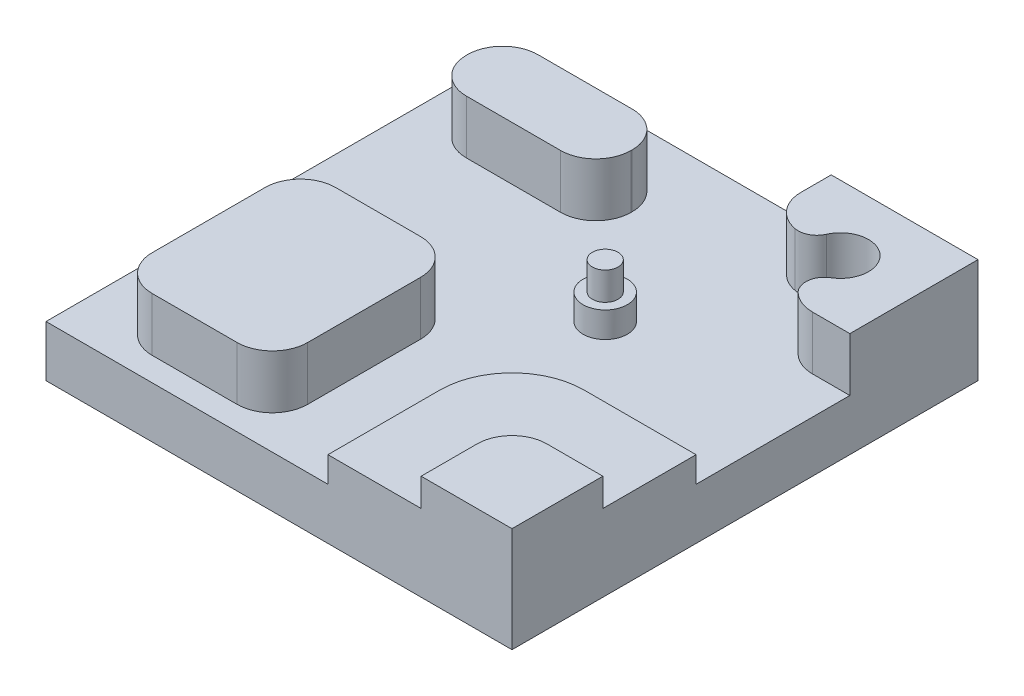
ISO-10303-21;
HEADER;
FILE_DESCRIPTION(('STEP AP214'),'2;1');
FILE_NAME('part.step','',(''),(''),'','','');
FILE_SCHEMA(('AUTOMOTIVE_DESIGN { 1 0 10303 214 1 1 1 1 }'));
ENDSEC;
DATA;
#1=APPLICATION_CONTEXT('core data for automotive mechanical design processes');
#2=APPLICATION_PROTOCOL_DEFINITION('international standard','automotive_design',2000,#1);
#3=PRODUCT_CONTEXT('',#1,'mechanical');
#4=PRODUCT('Part','Part','',(#3));
#5=PRODUCT_RELATED_PRODUCT_CATEGORY('part','',(#4));
#6=PRODUCT_DEFINITION_FORMATION('','',#4);
#7=PRODUCT_DEFINITION_CONTEXT('part definition',#1,'design');
#8=PRODUCT_DEFINITION('design','',#6,#7);
#9=PRODUCT_DEFINITION_SHAPE('','',#8);
#10=(LENGTH_UNIT() NAMED_UNIT(*) SI_UNIT(.MILLI.,.METRE.));
#11=(NAMED_UNIT(*) PLANE_ANGLE_UNIT() SI_UNIT($,.RADIAN.));
#12=(NAMED_UNIT(*) SI_UNIT($,.STERADIAN.) SOLID_ANGLE_UNIT());
#13=UNCERTAINTY_MEASURE_WITH_UNIT(LENGTH_MEASURE(1.E-05),#10,'distance_accuracy_value','');
#14=(GEOMETRIC_REPRESENTATION_CONTEXT(3) GLOBAL_UNCERTAINTY_ASSIGNED_CONTEXT((#13)) GLOBAL_UNIT_ASSIGNED_CONTEXT((#10,
#11,#12)) REPRESENTATION_CONTEXT('',''));
#15=CARTESIAN_POINT('',(0.,0.,0.));
#16=DIRECTION('',(0.,0.,1.));
#17=DIRECTION('',(1.,0.,0.));
#18=AXIS2_PLACEMENT_3D('',#15,#16,#17);
#19=CARTESIAN_POINT('',(0.,5.5,0.));
#20=DIRECTION('',(0.,-1.,0.));
#21=DIRECTION('',(0.,0.,-1.));
#22=AXIS2_PLACEMENT_3D('',#19,#20,#21);
#23=PLANE('',#22);
#24=CARTESIAN_POINT('',(5.,5.5,-5.00000000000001));
#25=DIRECTION('',(0.,-1.,0.));
#26=DIRECTION('',(0.,0.,-1.));
#27=AXIS2_PLACEMENT_3D('',#24,#25,#26);
#28=CIRCLE('',#27,2.375);
#29=CARTESIAN_POINT('',(5.,5.5,-7.37500000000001));
#30=VERTEX_POINT('',#29);
#31=EDGE_CURVE('E552',#30,#30,#28,.F.);
#32=ORIENTED_EDGE('',*,*,#31,.F.);
#33=EDGE_LOOP('',(#32));
#34=FACE_BOUND('',#33,.T.);
#35=DIRECTION('',(0.,0.,1.));
#36=VECTOR('',#35,1.);
#37=CARTESIAN_POINT('',(-19.95,5.5,22.45));
#38=LINE('',#37,#36);
#39=CARTESIAN_POINT('',(-19.95,5.5,6.54999999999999));
#40=VERTEX_POINT('',#39);
#41=CARTESIAN_POINT('',(-19.95,5.5,18.66));
#42=VERTEX_POINT('',#41);
#43=EDGE_CURVE('E625',#40,#42,#38,.T.);
#44=ORIENTED_EDGE('',*,*,#43,.F.);
#45=CARTESIAN_POINT('',(-16.16,5.5,6.54999999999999));
#46=DIRECTION('',(0.,-1.,0.));
#47=DIRECTION('',(0.,0.,-1.));
#48=AXIS2_PLACEMENT_3D('',#45,#46,#47);
#49=CIRCLE('',#48,3.79);
#50=CARTESIAN_POINT('',(-16.16,5.5,2.75999999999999));
#51=VERTEX_POINT('',#50);
#52=EDGE_CURVE('E491',#40,#51,#49,.T.);
#53=ORIENTED_EDGE('',*,*,#52,.T.);
#54=DIRECTION('',(-1.,0.,0.));
#55=VECTOR('',#54,1.);
#56=CARTESIAN_POINT('',(-19.95,5.5,2.75999999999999));
#57=LINE('',#56,#55);
#58=CARTESIAN_POINT('',(-7.05000000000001,5.5,2.75999999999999));
#59=VERTEX_POINT('',#58);
#60=EDGE_CURVE('E638',#59,#51,#57,.T.);
#61=ORIENTED_EDGE('',*,*,#60,.F.);
#62=CARTESIAN_POINT('',(-7.05000000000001,5.5,6.54999999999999));
#63=DIRECTION('',(0.,-1.,0.));
#64=DIRECTION('',(0.,0.,-1.));
#65=AXIS2_PLACEMENT_3D('',#62,#63,#64);
#66=CIRCLE('',#65,3.79);
#67=CARTESIAN_POINT('',(-3.26000000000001,5.5,6.54999999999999));
#68=VERTEX_POINT('',#67);
#69=EDGE_CURVE('E488',#59,#68,#66,.T.);
#70=ORIENTED_EDGE('',*,*,#69,.T.);
#71=DIRECTION('',(0.,0.,-1.));
#72=VECTOR('',#71,1.);
#73=CARTESIAN_POINT('',(-3.26000000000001,5.5,22.45));
#74=LINE('',#73,#72);
#75=CARTESIAN_POINT('',(-3.26000000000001,5.5,18.66));
#76=VERTEX_POINT('',#75);
#77=EDGE_CURVE('E634',#76,#68,#74,.T.);
#78=ORIENTED_EDGE('',*,*,#77,.F.);
#79=CARTESIAN_POINT('',(-7.05000000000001,5.5,18.66));
#80=DIRECTION('',(0.,-1.,0.));
#81=DIRECTION('',(0.,0.,-1.));
#82=AXIS2_PLACEMENT_3D('',#79,#80,#81);
#83=CIRCLE('',#82,3.79);
#84=CARTESIAN_POINT('',(-7.05000000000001,5.5,22.45));
#85=VERTEX_POINT('',#84);
#86=EDGE_CURVE('E494',#76,#85,#83,.T.);
#87=ORIENTED_EDGE('',*,*,#86,.T.);
#88=DIRECTION('',(1.,0.,0.));
#89=VECTOR('',#88,1.);
#90=CARTESIAN_POINT('',(-19.95,5.5,22.45));
#91=LINE('',#90,#89);
#92=CARTESIAN_POINT('',(-16.16,5.5,22.45));
#93=VERTEX_POINT('',#92);
#94=EDGE_CURVE('E629',#93,#85,#91,.T.);
#95=ORIENTED_EDGE('',*,*,#94,.F.);
#96=CARTESIAN_POINT('',(-16.16,5.5,18.66));
#97=DIRECTION('',(0.,-1.,0.));
#98=DIRECTION('',(0.,0.,-1.));
#99=AXIS2_PLACEMENT_3D('',#96,#97,#98);
#100=CIRCLE('',#99,3.79);
#101=EDGE_CURVE('E497',#93,#42,#100,.T.);
#102=ORIENTED_EDGE('',*,*,#101,.T.);
#103=EDGE_LOOP('',(#44,#53,#61,#70,#78,#87,#95,#102));
#104=FACE_BOUND('',#103,.T.);
#105=CARTESIAN_POINT('',(21.,5.5,-15.));
#106=DIRECTION('',(0.,-1.,0.));
#107=DIRECTION('',(0.,0.,-1.));
#108=AXIS2_PLACEMENT_3D('',#105,#106,#107);
#109=CIRCLE('',#108,3.75);
#110=CARTESIAN_POINT('',(21.,5.5,-11.25));
#111=VERTEX_POINT('',#110);
#112=CARTESIAN_POINT('',(18.466653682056,5.5,-12.2351028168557));
#113=VERTEX_POINT('',#112);
#114=EDGE_CURVE('E442',#111,#113,#109,.T.);
#115=ORIENTED_EDGE('',*,*,#114,.T.);
#116=CARTESIAN_POINT('',(19.8177717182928,5.5,-13.709714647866));
#117=DIRECTION('',(0.,-1.,0.));
#118=DIRECTION('',(0.,0.,-1.));
#119=AXIS2_PLACEMENT_3D('',#116,#117,#118);
#120=CIRCLE('',#119,2.);
#121=CARTESIAN_POINT('',(18.7906630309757,5.5,-15.4258287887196));
#122=VERTEX_POINT('',#121);
#123=EDGE_CURVE('E50',#113,#122,#120,.T.);
#124=ORIENTED_EDGE('',*,*,#123,.T.);
#125=CARTESIAN_POINT('',(17.25,5.5,-18.));
#126=DIRECTION('',(0.,1.,0.));
#127=DIRECTION('',(0.,0.,1.));
#128=AXIS2_PLACEMENT_3D('',#125,#126,#127);
#129=CIRCLE('',#128,3.);
#130=CARTESIAN_POINT('',(14.5082300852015,5.5,-19.2176607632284));
#131=VERTEX_POINT('',#130);
#132=EDGE_CURVE('E597',#122,#131,#129,.T.);
#133=ORIENTED_EDGE('',*,*,#132,.T.);
#134=CARTESIAN_POINT('',(12.6803834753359,5.5,-20.0294346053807));
#135=DIRECTION('',(0.,-1.,0.));
#136=DIRECTION('',(0.,0.,-1.));
#137=AXIS2_PLACEMENT_3D('',#134,#135,#136);
#138=CIRCLE('',#137,2.);
#139=CARTESIAN_POINT('',(12.3151074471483,5.5,-18.0630741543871));
#140=VERTEX_POINT('',#139);
#141=EDGE_CURVE('E11',#131,#140,#138,.T.);
#142=ORIENTED_EDGE('',*,*,#141,.T.);
#143=CARTESIAN_POINT('',(13.,5.5,-21.75));
#144=DIRECTION('',(0.,-1.,0.));
#145=DIRECTION('',(0.,0.,-1.));
#146=AXIS2_PLACEMENT_3D('',#143,#144,#145);
#147=CIRCLE('',#146,3.75);
#148=CARTESIAN_POINT('',(9.25000000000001,5.5,-21.75));
#149=VERTEX_POINT('',#148);
#150=EDGE_CURVE('E445',#140,#149,#147,.T.);
#151=ORIENTED_EDGE('',*,*,#150,.T.);
#152=DIRECTION('',(0.,0.,1.));
#153=VECTOR('',#152,1.);
#154=CARTESIAN_POINT('',(9.25000000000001,5.5,-25.));
#155=LINE('',#154,#153);
#156=CARTESIAN_POINT('',(9.25000000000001,5.5,-25.));
#157=VERTEX_POINT('',#156);
#158=EDGE_CURVE('E299',#157,#149,#155,.T.);
#159=ORIENTED_EDGE('',*,*,#158,.F.);
#160=DIRECTION('',(-1.,0.,0.));
#161=VECTOR('',#160,1.);
#162=CARTESIAN_POINT('',(25.,5.5,-25.));
#163=LINE('',#162,#161);
#164=CARTESIAN_POINT('',(-25.,5.5,-25.));
#165=VERTEX_POINT('',#164);
#166=EDGE_CURVE('E376',#157,#165,#163,.T.);
#167=ORIENTED_EDGE('',*,*,#166,.T.);
#168=DIRECTION('',(0.,0.,-1.));
#169=VECTOR('',#168,1.);
#170=CARTESIAN_POINT('',(-25.,5.5,25.));
#171=LINE('',#170,#169);
#172=CARTESIAN_POINT('',(-25.,5.5,25.));
#173=VERTEX_POINT('',#172);
#174=EDGE_CURVE('E379',#173,#165,#171,.T.);
#175=ORIENTED_EDGE('',*,*,#174,.F.);
#176=DIRECTION('',(-1.,0.,0.));
#177=VECTOR('',#176,1.);
#178=CARTESIAN_POINT('',(25.,5.5,25.));
#179=LINE('',#178,#177);
#180=CARTESIAN_POINT('',(5.25,5.5,25.));
#181=VERTEX_POINT('',#180);
#182=EDGE_CURVE('E384',#181,#173,#179,.T.);
#183=ORIENTED_EDGE('',*,*,#182,.F.);
#184=DIRECTION('',(0.,0.,1.));
#185=VECTOR('',#184,1.);
#186=CARTESIAN_POINT('',(5.25,5.5,25.));
#187=LINE('',#186,#185);
#188=CARTESIAN_POINT('',(5.25,5.5,13.));
#189=VERTEX_POINT('',#188);
#190=EDGE_CURVE('E325',#189,#181,#187,.T.);
#191=ORIENTED_EDGE('',*,*,#190,.F.);
#192=CARTESIAN_POINT('',(13.,5.5,13.));
#193=DIRECTION('',(0.,-1.,0.));
#194=DIRECTION('',(0.,0.,-1.));
#195=AXIS2_PLACEMENT_3D('',#192,#193,#194);
#196=CIRCLE('',#195,7.75);
#197=CARTESIAN_POINT('',(13.,5.5,5.24999999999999));
#198=VERTEX_POINT('',#197);
#199=EDGE_CURVE('E572',#189,#198,#196,.T.);
#200=ORIENTED_EDGE('',*,*,#199,.T.);
#201=DIRECTION('',(-1.,0.,0.));
#202=VECTOR('',#201,1.);
#203=CARTESIAN_POINT('',(25.,5.5,5.24999999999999));
#204=LINE('',#203,#202);
#205=CARTESIAN_POINT('',(25.,5.5,5.24999999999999));
#206=VERTEX_POINT('',#205);
#207=EDGE_CURVE('E320',#206,#198,#204,.T.);
#208=ORIENTED_EDGE('',*,*,#207,.F.);
#209=DIRECTION('',(0.,0.,-1.));
#210=VECTOR('',#209,1.);
#211=CARTESIAN_POINT('',(25.,5.5,25.));
#212=LINE('',#211,#210);
#213=CARTESIAN_POINT('',(25.,5.5,-11.25));
#214=VERTEX_POINT('',#213);
#215=EDGE_CURVE('E387',#206,#214,#212,.T.);
#216=ORIENTED_EDGE('',*,*,#215,.T.);
#217=DIRECTION('',(1.,0.,0.));
#218=VECTOR('',#217,1.);
#219=CARTESIAN_POINT('',(25.,5.5,-11.25));
#220=LINE('',#219,#218);
#221=EDGE_CURVE('E287',#111,#214,#220,.T.);
#222=ORIENTED_EDGE('',*,*,#221,.F.);
#223=EDGE_LOOP('',(#115,#124,#133,#142,#151,#159,#167,#175,#183,#191,#200,#208,#216,#222));
#224=FACE_BOUND('',#223,.T.);
#225=DIRECTION('',(0.,0.,1.));
#226=VECTOR('',#225,1.);
#227=CARTESIAN_POINT('',(-21.44,5.5,-20.44));
#228=LINE('',#227,#226);
#229=CARTESIAN_POINT('',(-21.44,5.5,-16.65));
#230=VERTEX_POINT('',#229);
#231=CARTESIAN_POINT('',(-21.44,5.5,-16.54));
#232=VERTEX_POINT('',#231);
#233=EDGE_CURVE('E666',#230,#232,#228,.T.);
#234=ORIENTED_EDGE('',*,*,#233,.F.);
#235=CARTESIAN_POINT('',(-17.65,5.5,-16.65));
#236=DIRECTION('',(0.,-1.,0.));
#237=DIRECTION('',(0.,0.,-1.));
#238=AXIS2_PLACEMENT_3D('',#235,#236,#237);
#239=CIRCLE('',#238,3.79);
#240=CARTESIAN_POINT('',(-17.65,5.5,-20.44));
#241=VERTEX_POINT('',#240);
#242=EDGE_CURVE('E549',#230,#241,#239,.T.);
#243=ORIENTED_EDGE('',*,*,#242,.T.);
#244=DIRECTION('',(-1.,0.,0.));
#245=VECTOR('',#244,1.);
#246=CARTESIAN_POINT('',(-21.44,5.5,-20.44));
#247=LINE('',#246,#245);
#248=CARTESIAN_POINT('',(-7.54,5.5,-20.44));
#249=VERTEX_POINT('',#248);
#250=EDGE_CURVE('E653',#249,#241,#247,.T.);
#251=ORIENTED_EDGE('',*,*,#250,.F.);
#252=CARTESIAN_POINT('',(-7.54,5.5,-16.65));
#253=DIRECTION('',(0.,-1.,0.));
#254=DIRECTION('',(0.,0.,-1.));
#255=AXIS2_PLACEMENT_3D('',#252,#253,#254);
#256=CIRCLE('',#255,3.79);
#257=CARTESIAN_POINT('',(-3.75,5.5,-16.65));
#258=VERTEX_POINT('',#257);
#259=EDGE_CURVE('E546',#249,#258,#256,.T.);
#260=ORIENTED_EDGE('',*,*,#259,.T.);
#261=DIRECTION('',(0.,0.,-1.));
#262=VECTOR('',#261,1.);
#263=CARTESIAN_POINT('',(-3.75,5.5,-20.44));
#264=LINE('',#263,#262);
#265=CARTESIAN_POINT('',(-3.75,5.5,-16.54));
#266=VERTEX_POINT('',#265);
#267=EDGE_CURVE('E658',#266,#258,#264,.T.);
#268=ORIENTED_EDGE('',*,*,#267,.F.);
#269=CARTESIAN_POINT('',(-7.54,5.5,-16.54));
#270=DIRECTION('',(0.,-1.,0.));
#271=DIRECTION('',(0.,0.,-1.));
#272=AXIS2_PLACEMENT_3D('',#269,#270,#271);
#273=CIRCLE('',#272,3.79);
#274=CARTESIAN_POINT('',(-7.54,5.5,-12.75));
#275=VERTEX_POINT('',#274);
#276=EDGE_CURVE('E540',#266,#275,#273,.T.);
#277=ORIENTED_EDGE('',*,*,#276,.T.);
#278=DIRECTION('',(1.,0.,0.));
#279=VECTOR('',#278,1.);
#280=CARTESIAN_POINT('',(-21.44,5.5,-12.75));
#281=LINE('',#280,#279);
#282=CARTESIAN_POINT('',(-17.65,5.5,-12.75));
#283=VERTEX_POINT('',#282);
#284=EDGE_CURVE('E662',#283,#275,#281,.T.);
#285=ORIENTED_EDGE('',*,*,#284,.F.);
#286=CARTESIAN_POINT('',(-17.65,5.5,-16.54));
#287=DIRECTION('',(0.,-1.,0.));
#288=DIRECTION('',(0.,0.,-1.));
#289=AXIS2_PLACEMENT_3D('',#286,#287,#288);
#290=CIRCLE('',#289,3.79);
#291=EDGE_CURVE('E543',#283,#232,#290,.T.);
#292=ORIENTED_EDGE('',*,*,#291,.T.);
#293=EDGE_LOOP('',(#234,#243,#251,#260,#268,#277,#285,#292));
#294=FACE_BOUND('',#293,.T.);
#295=ADVANCED_FACE('F41',(#34,#104,#224,#294),#23,.F.);
#296=CARTESIAN_POINT('',(25.,5.5,-25.));
#297=DIRECTION('',(0.,0.,1.));
#298=DIRECTION('',(1.,0.,0.));
#299=AXIS2_PLACEMENT_3D('',#296,#297,#298);
#300=PLANE('',#299);
#301=DIRECTION('',(-1.,0.,0.));
#302=VECTOR('',#301,1.);
#303=CARTESIAN_POINT('',(25.,0.,-25.));
#304=LINE('',#303,#302);
#305=CARTESIAN_POINT('',(25.,0.,-25.));
#306=VERTEX_POINT('',#305);
#307=CARTESIAN_POINT('',(-25.,0.,-25.));
#308=VERTEX_POINT('',#307);
#309=EDGE_CURVE('E375',#306,#308,#304,.T.);
#310=ORIENTED_EDGE('',*,*,#309,.T.);
#311=DIRECTION('',(0.,-1.,0.));
#312=VECTOR('',#311,1.);
#313=CARTESIAN_POINT('',(-25.,5.5,-25.));
#314=LINE('',#313,#312);
#315=EDGE_CURVE('E411',#165,#308,#314,.T.);
#316=ORIENTED_EDGE('',*,*,#315,.F.);
#317=ORIENTED_EDGE('',*,*,#166,.F.);
#318=DIRECTION('',(0.,-1.,0.));
#319=VECTOR('',#318,1.);
#320=CARTESIAN_POINT('',(9.25000000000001,11.25,-25.));
#321=LINE('',#320,#319);
#322=CARTESIAN_POINT('',(9.25000000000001,11.25,-25.));
#323=VERTEX_POINT('',#322);
#324=EDGE_CURVE('E315',#323,#157,#321,.T.);
#325=ORIENTED_EDGE('',*,*,#324,.F.);
#326=DIRECTION('',(-1.,0.,0.));
#327=VECTOR('',#326,1.);
#328=CARTESIAN_POINT('',(25.,11.25,-25.));
#329=LINE('',#328,#327);
#330=CARTESIAN_POINT('',(25.,11.25,-25.));
#331=VERTEX_POINT('',#330);
#332=EDGE_CURVE('E298',#331,#323,#329,.T.);
#333=ORIENTED_EDGE('',*,*,#332,.F.);
#334=DIRECTION('',(0.,-1.,0.));
#335=VECTOR('',#334,1.);
#336=CARTESIAN_POINT('',(25.,5.5,-25.));
#337=LINE('',#336,#335);
#338=EDGE_CURVE('E295',#331,#306,#337,.T.);
#339=ORIENTED_EDGE('',*,*,#338,.T.);
#340=EDGE_LOOP('',(#310,#316,#317,#325,#333,#339));
#341=FACE_BOUND('',#340,.T.);
#342=ADVANCED_FACE('F705',(#341),#300,.F.);
#343=CARTESIAN_POINT('',(-25.,5.5,25.));
#344=DIRECTION('',(-1.,0.,0.));
#345=DIRECTION('',(0.,0.,1.));
#346=AXIS2_PLACEMENT_3D('',#343,#344,#345);
#347=PLANE('',#346);
#348=DIRECTION('',(0.,0.,-1.));
#349=VECTOR('',#348,1.);
#350=CARTESIAN_POINT('',(-25.,0.,25.));
#351=LINE('',#350,#349);
#352=CARTESIAN_POINT('',(-25.,0.,25.));
#353=VERTEX_POINT('',#352);
#354=EDGE_CURVE('E393',#353,#308,#351,.T.);
#355=ORIENTED_EDGE('',*,*,#354,.F.);
#356=DIRECTION('',(0.,-1.,0.));
#357=VECTOR('',#356,1.);
#358=CARTESIAN_POINT('',(-25.,5.5,25.));
#359=LINE('',#358,#357);
#360=EDGE_CURVE('E408',#173,#353,#359,.T.);
#361=ORIENTED_EDGE('',*,*,#360,.F.);
#362=ORIENTED_EDGE('',*,*,#174,.T.);
#363=ORIENTED_EDGE('',*,*,#315,.T.);
#364=EDGE_LOOP('',(#355,#361,#362,#363));
#365=FACE_BOUND('',#364,.T.);
#366=ADVANCED_FACE('F710',(#365),#347,.T.);
#367=CARTESIAN_POINT('',(25.,5.5,25.));
#368=DIRECTION('',(0.,0.,1.));
#369=DIRECTION('',(1.,0.,0.));
#370=AXIS2_PLACEMENT_3D('',#367,#368,#369);
#371=PLANE('',#370);
#372=DIRECTION('',(0.,-1.,0.));
#373=VECTOR('',#372,1.);
#374=CARTESIAN_POINT('',(15.25,11.25,25.));
#375=LINE('',#374,#373);
#376=CARTESIAN_POINT('',(15.25,11.25,25.));
#377=VERTEX_POINT('',#376);
#378=CARTESIAN_POINT('',(15.25,8.25,25.));
#379=VERTEX_POINT('',#378);
#380=EDGE_CURVE('E367',#377,#379,#375,.T.);
#381=ORIENTED_EDGE('',*,*,#380,.T.);
#382=DIRECTION('',(1.,0.,0.));
#383=VECTOR('',#382,1.);
#384=CARTESIAN_POINT('',(25.,8.25,25.));
#385=LINE('',#384,#383);
#386=CARTESIAN_POINT('',(5.25,8.25,25.));
#387=VERTEX_POINT('',#386);
#388=EDGE_CURVE('E332',#387,#379,#385,.T.);
#389=ORIENTED_EDGE('',*,*,#388,.F.);
#390=DIRECTION('',(0.,-1.,0.));
#391=VECTOR('',#390,1.);
#392=CARTESIAN_POINT('',(5.25,8.25,25.));
#393=LINE('',#392,#391);
#394=EDGE_CURVE('E336',#387,#181,#393,.T.);
#395=ORIENTED_EDGE('',*,*,#394,.T.);
#396=ORIENTED_EDGE('',*,*,#182,.T.);
#397=ORIENTED_EDGE('',*,*,#360,.T.);
#398=DIRECTION('',(-1.,0.,0.));
#399=VECTOR('',#398,1.);
#400=CARTESIAN_POINT('',(25.,0.,25.));
#401=LINE('',#400,#399);
#402=CARTESIAN_POINT('',(25.,0.,25.));
#403=VERTEX_POINT('',#402);
#404=EDGE_CURVE('E397',#403,#353,#401,.T.);
#405=ORIENTED_EDGE('',*,*,#404,.F.);
#406=DIRECTION('',(0.,-1.,0.));
#407=VECTOR('',#406,1.);
#408=CARTESIAN_POINT('',(25.,5.5,25.));
#409=LINE('',#408,#407);
#410=CARTESIAN_POINT('',(25.,11.25,25.));
#411=VERTEX_POINT('',#410);
#412=EDGE_CURVE('E405',#411,#403,#409,.T.);
#413=ORIENTED_EDGE('',*,*,#412,.F.);
#414=DIRECTION('',(1.,0.,0.));
#415=VECTOR('',#414,1.);
#416=CARTESIAN_POINT('',(25.,11.25,25.));
#417=LINE('',#416,#415);
#418=EDGE_CURVE('E363',#377,#411,#417,.T.);
#419=ORIENTED_EDGE('',*,*,#418,.F.);
#420=EDGE_LOOP('',(#381,#389,#395,#396,#397,#405,#413,#419));
#421=FACE_BOUND('',#420,.T.);
#422=ADVANCED_FACE('F714',(#421),#371,.T.);
#423=CARTESIAN_POINT('',(25.,5.5,25.));
#424=DIRECTION('',(-1.,0.,0.));
#425=DIRECTION('',(0.,0.,1.));
#426=AXIS2_PLACEMENT_3D('',#423,#424,#425);
#427=PLANE('',#426);
#428=ORIENTED_EDGE('',*,*,#412,.T.);
#429=DIRECTION('',(0.,0.,-1.));
#430=VECTOR('',#429,1.);
#431=CARTESIAN_POINT('',(25.,0.,25.));
#432=LINE('',#431,#430);
#433=EDGE_CURVE('E380',#403,#306,#432,.T.);
#434=ORIENTED_EDGE('',*,*,#433,.T.);
#435=ORIENTED_EDGE('',*,*,#338,.F.);
#436=DIRECTION('',(0.,0.,-1.));
#437=VECTOR('',#436,1.);
#438=CARTESIAN_POINT('',(25.,11.25,-25.));
#439=LINE('',#438,#437);
#440=CARTESIAN_POINT('',(25.,11.25,-11.25));
#441=VERTEX_POINT('',#440);
#442=EDGE_CURVE('E279',#441,#331,#439,.T.);
#443=ORIENTED_EDGE('',*,*,#442,.F.);
#444=DIRECTION('',(0.,-1.,0.));
#445=VECTOR('',#444,1.);
#446=CARTESIAN_POINT('',(25.,11.25,-11.25));
#447=LINE('',#446,#445);
#448=EDGE_CURVE('E286',#441,#214,#447,.T.);
#449=ORIENTED_EDGE('',*,*,#448,.T.);
#450=ORIENTED_EDGE('',*,*,#215,.F.);
#451=DIRECTION('',(0.,-1.,0.));
#452=VECTOR('',#451,1.);
#453=CARTESIAN_POINT('',(25.,8.25,5.24999999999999));
#454=LINE('',#453,#452);
#455=CARTESIAN_POINT('',(25.,8.25,5.24999999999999));
#456=VERTEX_POINT('',#455);
#457=EDGE_CURVE('E345',#456,#206,#454,.T.);
#458=ORIENTED_EDGE('',*,*,#457,.F.);
#459=DIRECTION('',(0.,0.,-1.));
#460=VECTOR('',#459,1.);
#461=CARTESIAN_POINT('',(25.,8.25,25.));
#462=LINE('',#461,#460);
#463=CARTESIAN_POINT('',(25.,8.25,15.25));
#464=VERTEX_POINT('',#463);
#465=EDGE_CURVE('E321',#464,#456,#462,.T.);
#466=ORIENTED_EDGE('',*,*,#465,.F.);
#467=DIRECTION('',(0.,-1.,0.));
#468=VECTOR('',#467,1.);
#469=CARTESIAN_POINT('',(25.,11.25,15.25));
#470=LINE('',#469,#468);
#471=CARTESIAN_POINT('',(25.,11.25,15.25));
#472=VERTEX_POINT('',#471);
#473=EDGE_CURVE('E371',#472,#464,#470,.T.);
#474=ORIENTED_EDGE('',*,*,#473,.F.);
#475=DIRECTION('',(0.,0.,-1.));
#476=VECTOR('',#475,1.);
#477=CARTESIAN_POINT('',(25.,11.25,25.));
#478=LINE('',#477,#476);
#479=EDGE_CURVE('E352',#411,#472,#478,.T.);
#480=ORIENTED_EDGE('',*,*,#479,.F.);
#481=EDGE_LOOP('',(#428,#434,#435,#443,#449,#450,#458,#466,#474,#480));
#482=FACE_BOUND('',#481,.T.);
#483=ADVANCED_FACE('F291',(#482),#427,.F.);
#484=CARTESIAN_POINT('',(0.,0.,0.));
#485=DIRECTION('',(0.,-1.,0.));
#486=DIRECTION('',(0.,0.,-1.));
#487=AXIS2_PLACEMENT_3D('',#484,#485,#486);
#488=PLANE('',#487);
#489=ORIENTED_EDGE('',*,*,#309,.F.);
#490=ORIENTED_EDGE('',*,*,#433,.F.);
#491=ORIENTED_EDGE('',*,*,#404,.T.);
#492=ORIENTED_EDGE('',*,*,#354,.T.);
#493=EDGE_LOOP('',(#489,#490,#491,#492));
#494=FACE_BOUND('',#493,.T.);
#495=ADVANCED_FACE('F743',(#494),#488,.T.);
#496=CARTESIAN_POINT('',(25.,11.25,15.25));
#497=DIRECTION('',(0.,0.,1.));
#498=DIRECTION('',(1.,0.,0.));
#499=AXIS2_PLACEMENT_3D('',#496,#497,#498);
#500=PLANE('',#499);
#501=DIRECTION('',(-1.,0.,0.));
#502=VECTOR('',#501,1.);
#503=CARTESIAN_POINT('',(25.,8.25,15.25));
#504=LINE('',#503,#502);
#505=CARTESIAN_POINT('',(19.,8.25,15.25));
#506=VERTEX_POINT('',#505);
#507=EDGE_CURVE('E348',#464,#506,#504,.T.);
#508=ORIENTED_EDGE('',*,*,#507,.T.);
#509=DIRECTION('',(0.,-1.,0.));
#510=VECTOR('',#509,1.);
#511=CARTESIAN_POINT('',(19.,11.25,15.25));
#512=LINE('',#511,#510);
#513=CARTESIAN_POINT('',(19.,11.25,15.25));
#514=VERTEX_POINT('',#513);
#515=EDGE_CURVE('E421',#506,#514,#512,.F.);
#516=ORIENTED_EDGE('',*,*,#515,.T.);
#517=DIRECTION('',(-1.,0.,0.));
#518=VECTOR('',#517,1.);
#519=CARTESIAN_POINT('',(25.,11.25,15.25));
#520=LINE('',#519,#518);
#521=EDGE_CURVE('E356',#472,#514,#520,.T.);
#522=ORIENTED_EDGE('',*,*,#521,.F.);
#523=ORIENTED_EDGE('',*,*,#473,.T.);
#524=EDGE_LOOP('',(#508,#516,#522,#523));
#525=FACE_BOUND('',#524,.T.);
#526=ADVANCED_FACE('F735',(#525),#500,.F.);
#527=CARTESIAN_POINT('',(15.25,11.25,25.));
#528=DIRECTION('',(1.,0.,0.));
#529=DIRECTION('',(0.,0.,-1.));
#530=AXIS2_PLACEMENT_3D('',#527,#528,#529);
#531=PLANE('',#530);
#532=DIRECTION('',(0.,0.,1.));
#533=VECTOR('',#532,1.);
#534=CARTESIAN_POINT('',(15.25,11.25,25.));
#535=LINE('',#534,#533);
#536=CARTESIAN_POINT('',(15.25,11.25,19.));
#537=VERTEX_POINT('',#536);
#538=EDGE_CURVE('E360',#537,#377,#535,.T.);
#539=ORIENTED_EDGE('',*,*,#538,.F.);
#540=DIRECTION('',(0.,-1.,0.));
#541=VECTOR('',#540,1.);
#542=CARTESIAN_POINT('',(15.25,11.25,19.));
#543=LINE('',#542,#541);
#544=CARTESIAN_POINT('',(15.25,8.25,19.));
#545=VERTEX_POINT('',#544);
#546=EDGE_CURVE('E417',#537,#545,#543,.T.);
#547=ORIENTED_EDGE('',*,*,#546,.T.);
#548=DIRECTION('',(0.,0.,1.));
#549=VECTOR('',#548,1.);
#550=CARTESIAN_POINT('',(15.25,8.25,25.));
#551=LINE('',#550,#549);
#552=EDGE_CURVE('E414',#545,#379,#551,.T.);
#553=ORIENTED_EDGE('',*,*,#552,.T.);
#554=ORIENTED_EDGE('',*,*,#380,.F.);
#555=EDGE_LOOP('',(#539,#547,#553,#554));
#556=FACE_BOUND('',#555,.T.);
#557=ADVANCED_FACE('F750',(#556),#531,.F.);
#558=CARTESIAN_POINT('',(0.,11.25,0.));
#559=DIRECTION('',(0.,1.,0.));
#560=DIRECTION('',(0.,0.,1.));
#561=AXIS2_PLACEMENT_3D('',#558,#559,#560);
#562=PLANE('',#561);
#563=ORIENTED_EDGE('',*,*,#521,.T.);
#564=CARTESIAN_POINT('',(19.,11.25,19.));
#565=DIRECTION('',(0.,1.,0.));
#566=DIRECTION('',(0.,0.,1.));
#567=AXIS2_PLACEMENT_3D('',#564,#565,#566);
#568=CIRCLE('',#567,3.75);
#569=EDGE_CURVE('E424',#514,#537,#568,.T.);
#570=ORIENTED_EDGE('',*,*,#569,.T.);
#571=ORIENTED_EDGE('',*,*,#538,.T.);
#572=ORIENTED_EDGE('',*,*,#418,.T.);
#573=ORIENTED_EDGE('',*,*,#479,.T.);
#574=EDGE_LOOP('',(#563,#570,#571,#572,#573));
#575=FACE_BOUND('',#574,.T.);
#576=ADVANCED_FACE('F739',(#575),#562,.T.);
#577=CARTESIAN_POINT('',(0.,8.25,0.));
#578=DIRECTION('',(0.,1.,0.));
#579=DIRECTION('',(0.,0.,1.));
#580=AXIS2_PLACEMENT_3D('',#577,#578,#579);
#581=PLANE('',#580);
#582=DIRECTION('',(-1.,0.,0.));
#583=VECTOR('',#582,1.);
#584=CARTESIAN_POINT('',(25.,8.25,5.24999999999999));
#585=LINE('',#584,#583);
#586=CARTESIAN_POINT('',(13.,8.25,5.24999999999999));
#587=VERTEX_POINT('',#586);
#588=EDGE_CURVE('E324',#456,#587,#585,.T.);
#589=ORIENTED_EDGE('',*,*,#588,.T.);
#590=CARTESIAN_POINT('',(13.,8.25,13.));
#591=DIRECTION('',(0.,1.,0.));
#592=DIRECTION('',(0.,0.,1.));
#593=AXIS2_PLACEMENT_3D('',#590,#591,#592);
#594=CIRCLE('',#593,7.75);
#595=CARTESIAN_POINT('',(5.25,8.25,13.));
#596=VERTEX_POINT('',#595);
#597=EDGE_CURVE('E569',#587,#596,#594,.T.);
#598=ORIENTED_EDGE('',*,*,#597,.T.);
#599=DIRECTION('',(0.,0.,1.));
#600=VECTOR('',#599,1.);
#601=CARTESIAN_POINT('',(5.25,8.25,25.));
#602=LINE('',#601,#600);
#603=EDGE_CURVE('E329',#596,#387,#602,.T.);
#604=ORIENTED_EDGE('',*,*,#603,.T.);
#605=ORIENTED_EDGE('',*,*,#388,.T.);
#606=ORIENTED_EDGE('',*,*,#552,.F.);
#607=CARTESIAN_POINT('',(19.,8.25,19.));
#608=DIRECTION('',(0.,1.,0.));
#609=DIRECTION('',(0.,0.,1.));
#610=AXIS2_PLACEMENT_3D('',#607,#608,#609);
#611=CIRCLE('',#610,3.75);
#612=EDGE_CURVE('E427',#545,#506,#611,.F.);
#613=ORIENTED_EDGE('',*,*,#612,.T.);
#614=ORIENTED_EDGE('',*,*,#507,.F.);
#615=ORIENTED_EDGE('',*,*,#465,.T.);
#616=EDGE_LOOP('',(#589,#598,#604,#605,#606,#613,#614,#615));
#617=FACE_BOUND('',#616,.T.);
#618=ADVANCED_FACE('F768',(#617),#581,.T.);
#619=CARTESIAN_POINT('',(25.,8.25,5.24999999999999));
#620=DIRECTION('',(0.,0.,1.));
#621=DIRECTION('',(1.,0.,0.));
#622=AXIS2_PLACEMENT_3D('',#619,#620,#621);
#623=PLANE('',#622);
#624=ORIENTED_EDGE('',*,*,#207,.T.);
#625=DIRECTION('',(0.,-1.,0.));
#626=VECTOR('',#625,1.);
#627=CARTESIAN_POINT('',(13.,8.25,5.24999999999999));
#628=LINE('',#627,#626);
#629=EDGE_CURVE('E566',#198,#587,#628,.F.);
#630=ORIENTED_EDGE('',*,*,#629,.T.);
#631=ORIENTED_EDGE('',*,*,#588,.F.);
#632=ORIENTED_EDGE('',*,*,#457,.T.);
#633=EDGE_LOOP('',(#624,#630,#631,#632));
#634=FACE_BOUND('',#633,.T.);
#635=ADVANCED_FACE('F727',(#634),#623,.F.);
#636=CARTESIAN_POINT('',(5.25,8.25,25.));
#637=DIRECTION('',(1.,0.,0.));
#638=DIRECTION('',(0.,0.,-1.));
#639=AXIS2_PLACEMENT_3D('',#636,#637,#638);
#640=PLANE('',#639);
#641=ORIENTED_EDGE('',*,*,#603,.F.);
#642=DIRECTION('',(0.,-1.,0.));
#643=VECTOR('',#642,1.);
#644=CARTESIAN_POINT('',(5.25,8.25,13.));
#645=LINE('',#644,#643);
#646=EDGE_CURVE('E556',#596,#189,#645,.T.);
#647=ORIENTED_EDGE('',*,*,#646,.T.);
#648=ORIENTED_EDGE('',*,*,#190,.T.);
#649=ORIENTED_EDGE('',*,*,#394,.F.);
#650=EDGE_LOOP('',(#641,#647,#648,#649));
#651=FACE_BOUND('',#650,.T.);
#652=ADVANCED_FACE('F720',(#651),#640,.F.);
#653=CARTESIAN_POINT('',(19.,11.25,19.));
#654=DIRECTION('',(0.,-1.,0.));
#655=DIRECTION('',(0.,0.,-1.));
#656=AXIS2_PLACEMENT_3D('',#653,#654,#655);
#657=CYLINDRICAL_SURFACE('',#656,3.75);
#658=ORIENTED_EDGE('',*,*,#569,.F.);
#659=ORIENTED_EDGE('',*,*,#515,.F.);
#660=ORIENTED_EDGE('',*,*,#612,.F.);
#661=ORIENTED_EDGE('',*,*,#546,.F.);
#662=EDGE_LOOP('',(#658,#659,#660,#661));
#663=FACE_BOUND('',#662,.T.);
#664=ADVANCED_FACE('F773',(#663),#657,.T.);
#665=CARTESIAN_POINT('',(9.25000000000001,11.25,-25.));
#666=DIRECTION('',(1.,0.,0.));
#667=DIRECTION('',(0.,0.,-1.));
#668=AXIS2_PLACEMENT_3D('',#665,#666,#667);
#669=PLANE('',#668);
#670=ORIENTED_EDGE('',*,*,#158,.T.);
#671=DIRECTION('',(0.,-1.,0.));
#672=VECTOR('',#671,1.);
#673=CARTESIAN_POINT('',(9.25000000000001,11.25,-21.75));
#674=LINE('',#673,#672);
#675=CARTESIAN_POINT('',(9.25000000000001,11.25,-21.75));
#676=VERTEX_POINT('',#675);
#677=EDGE_CURVE('E439',#149,#676,#674,.F.);
#678=ORIENTED_EDGE('',*,*,#677,.T.);
#679=DIRECTION('',(0.,0.,1.));
#680=VECTOR('',#679,1.);
#681=CARTESIAN_POINT('',(9.25000000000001,11.25,-25.));
#682=LINE('',#681,#680);
#683=EDGE_CURVE('E312',#323,#676,#682,.T.);
#684=ORIENTED_EDGE('',*,*,#683,.F.);
#685=ORIENTED_EDGE('',*,*,#324,.T.);
#686=EDGE_LOOP('',(#670,#678,#684,#685));
#687=FACE_BOUND('',#686,.T.);
#688=ADVANCED_FACE('F700',(#687),#669,.F.);
#689=CARTESIAN_POINT('',(0.,11.25,0.));
#690=DIRECTION('',(0.,-1.,0.));
#691=DIRECTION('',(0.,0.,-1.));
#692=AXIS2_PLACEMENT_3D('',#689,#690,#691);
#693=PLANE('',#692);
#694=CARTESIAN_POINT('',(17.25,11.25,-18.));
#695=DIRECTION('',(0.,1.,0.));
#696=DIRECTION('',(0.,0.,1.));
#697=AXIS2_PLACEMENT_3D('',#694,#695,#696);
#698=CIRCLE('',#697,3.);
#699=CARTESIAN_POINT('',(18.7906630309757,11.25,-15.4258287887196));
#700=VERTEX_POINT('',#699);
#701=CARTESIAN_POINT('',(14.5082300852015,11.25,-19.2176607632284));
#702=VERTEX_POINT('',#701);
#703=EDGE_CURVE('E605',#700,#702,#698,.T.);
#704=ORIENTED_EDGE('',*,*,#703,.F.);
#705=CARTESIAN_POINT('',(19.8177717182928,11.25,-13.709714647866));
#706=DIRECTION('',(0.,-1.,0.));
#707=DIRECTION('',(0.,0.,-1.));
#708=AXIS2_PLACEMENT_3D('',#705,#706,#707);
#709=CIRCLE('',#708,2.);
#710=CARTESIAN_POINT('',(18.466653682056,11.25,-12.2351028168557));
#711=VERTEX_POINT('',#710);
#712=EDGE_CURVE('E585',#700,#711,#709,.F.);
#713=ORIENTED_EDGE('',*,*,#712,.T.);
#714=CARTESIAN_POINT('',(21.,11.25,-15.));
#715=DIRECTION('',(0.,-1.,0.));
#716=DIRECTION('',(0.,0.,-1.));
#717=AXIS2_PLACEMENT_3D('',#714,#715,#716);
#718=CIRCLE('',#717,3.75);
#719=CARTESIAN_POINT('',(21.,11.25,-11.25));
#720=VERTEX_POINT('',#719);
#721=EDGE_CURVE('E280',#711,#720,#718,.F.);
#722=ORIENTED_EDGE('',*,*,#721,.T.);
#723=DIRECTION('',(1.,0.,0.));
#724=VECTOR('',#723,1.);
#725=CARTESIAN_POINT('',(25.,11.25,-11.25));
#726=LINE('',#725,#724);
#727=EDGE_CURVE('E275',#720,#441,#726,.T.);
#728=ORIENTED_EDGE('',*,*,#727,.T.);
#729=ORIENTED_EDGE('',*,*,#442,.T.);
#730=ORIENTED_EDGE('',*,*,#332,.T.);
#731=ORIENTED_EDGE('',*,*,#683,.T.);
#732=CARTESIAN_POINT('',(13.,11.25,-21.75));
#733=DIRECTION('',(0.,-1.,0.));
#734=DIRECTION('',(0.,0.,-1.));
#735=AXIS2_PLACEMENT_3D('',#732,#733,#734);
#736=CIRCLE('',#735,3.75);
#737=CARTESIAN_POINT('',(12.3151074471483,11.25,-18.0630741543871));
#738=VERTEX_POINT('',#737);
#739=EDGE_CURVE('E433',#676,#738,#736,.F.);
#740=ORIENTED_EDGE('',*,*,#739,.T.);
#741=CARTESIAN_POINT('',(12.6803834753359,11.25,-20.0294346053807));
#742=DIRECTION('',(0.,-1.,0.));
#743=DIRECTION('',(0.,0.,-1.));
#744=AXIS2_PLACEMENT_3D('',#741,#742,#743);
#745=CIRCLE('',#744,2.);
#746=EDGE_CURVE('E582',#738,#702,#745,.F.);
#747=ORIENTED_EDGE('',*,*,#746,.T.);
#748=EDGE_LOOP('',(#704,#713,#722,#728,#729,#730,#731,#740,#747));
#749=FACE_BOUND('',#748,.T.);
#750=ADVANCED_FACE('F278',(#749),#693,.F.);
#751=CARTESIAN_POINT('',(25.,11.25,-11.25));
#752=DIRECTION('',(0.,0.,-1.));
#753=DIRECTION('',(-1.,0.,0.));
#754=AXIS2_PLACEMENT_3D('',#751,#752,#753);
#755=PLANE('',#754);
#756=ORIENTED_EDGE('',*,*,#727,.F.);
#757=DIRECTION('',(0.,-1.,0.));
#758=VECTOR('',#757,1.);
#759=CARTESIAN_POINT('',(21.,11.25,-11.25));
#760=LINE('',#759,#758);
#761=EDGE_CURVE('E430',#720,#111,#760,.T.);
#762=ORIENTED_EDGE('',*,*,#761,.T.);
#763=ORIENTED_EDGE('',*,*,#221,.T.);
#764=ORIENTED_EDGE('',*,*,#448,.F.);
#765=EDGE_LOOP('',(#756,#762,#763,#764));
#766=FACE_BOUND('',#765,.T.);
#767=ADVANCED_FACE('F301',(#766),#755,.F.);
#768=CARTESIAN_POINT('',(21.,11.25,-15.));
#769=DIRECTION('',(0.,-1.,0.));
#770=DIRECTION('',(0.,0.,-1.));
#771=AXIS2_PLACEMENT_3D('',#768,#769,#770);
#772=CYLINDRICAL_SURFACE('',#771,3.75);
#773=ORIENTED_EDGE('',*,*,#721,.F.);
#774=DIRECTION('',(0.,-1.,0.));
#775=VECTOR('',#774,1.);
#776=CARTESIAN_POINT('',(18.466653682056,11.25,-12.2351028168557));
#777=LINE('',#776,#775);
#778=EDGE_CURVE('E63',#711,#113,#777,.T.);
#779=ORIENTED_EDGE('',*,*,#778,.T.);
#780=ORIENTED_EDGE('',*,*,#114,.F.);
#781=ORIENTED_EDGE('',*,*,#761,.F.);
#782=EDGE_LOOP('',(#773,#779,#780,#781));
#783=FACE_BOUND('',#782,.T.);
#784=ADVANCED_FACE('F608',(#783),#772,.T.);
#785=CARTESIAN_POINT('',(13.,11.25,-21.75));
#786=DIRECTION('',(0.,-1.,0.));
#787=DIRECTION('',(0.,0.,-1.));
#788=AXIS2_PLACEMENT_3D('',#785,#786,#787);
#789=CYLINDRICAL_SURFACE('',#788,3.75);
#790=ORIENTED_EDGE('',*,*,#150,.F.);
#791=DIRECTION('',(0.,-1.,0.));
#792=VECTOR('',#791,1.);
#793=CARTESIAN_POINT('',(12.3151074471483,11.25,-18.0630741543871));
#794=LINE('',#793,#792);
#795=EDGE_CURVE('E590',#140,#738,#794,.F.);
#796=ORIENTED_EDGE('',*,*,#795,.T.);
#797=ORIENTED_EDGE('',*,*,#739,.F.);
#798=ORIENTED_EDGE('',*,*,#677,.F.);
#799=EDGE_LOOP('',(#790,#796,#797,#798));
#800=FACE_BOUND('',#799,.T.);
#801=ADVANCED_FACE('F695',(#800),#789,.T.);
#802=CARTESIAN_POINT('',(-19.95,11.25,22.45));
#803=DIRECTION('',(1.,0.,0.));
#804=DIRECTION('',(0.,0.,-1.));
#805=AXIS2_PLACEMENT_3D('',#802,#803,#804);
#806=PLANE('',#805);
#807=DIRECTION('',(0.,0.,1.));
#808=VECTOR('',#807,1.);
#809=CARTESIAN_POINT('',(-19.95,11.25,22.45));
#810=LINE('',#809,#808);
#811=CARTESIAN_POINT('',(-19.95,11.25,6.54999999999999));
#812=VERTEX_POINT('',#811);
#813=CARTESIAN_POINT('',(-19.95,11.25,18.66));
#814=VERTEX_POINT('',#813);
#815=EDGE_CURVE('E641',#812,#814,#810,.T.);
#816=ORIENTED_EDGE('',*,*,#815,.F.);
#817=DIRECTION('',(0.,-1.,0.));
#818=VECTOR('',#817,1.);
#819=CARTESIAN_POINT('',(-19.95,11.25,6.54999999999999));
#820=LINE('',#819,#818);
#821=EDGE_CURVE('E477',#812,#40,#820,.T.);
#822=ORIENTED_EDGE('',*,*,#821,.T.);
#823=ORIENTED_EDGE('',*,*,#43,.T.);
#824=DIRECTION('',(0.,-1.,0.));
#825=VECTOR('',#824,1.);
#826=CARTESIAN_POINT('',(-19.95,11.25,18.66));
#827=LINE('',#826,#825);
#828=EDGE_CURVE('E474',#42,#814,#827,.F.);
#829=ORIENTED_EDGE('',*,*,#828,.T.);
#830=EDGE_LOOP('',(#816,#822,#823,#829));
#831=FACE_BOUND('',#830,.T.);
#832=ADVANCED_FACE('F782',(#831),#806,.F.);
#833=CARTESIAN_POINT('',(-19.95,11.25,22.45));
#834=DIRECTION('',(0.,0.,-1.));
#835=DIRECTION('',(-1.,0.,0.));
#836=AXIS2_PLACEMENT_3D('',#833,#834,#835);
#837=PLANE('',#836);
#838=ORIENTED_EDGE('',*,*,#94,.T.);
#839=DIRECTION('',(0.,-1.,0.));
#840=VECTOR('',#839,1.);
#841=CARTESIAN_POINT('',(-7.05000000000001,11.25,22.45));
#842=LINE('',#841,#840);
#843=CARTESIAN_POINT('',(-7.05000000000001,11.25,22.45));
#844=VERTEX_POINT('',#843);
#845=EDGE_CURVE('E485',#85,#844,#842,.F.);
#846=ORIENTED_EDGE('',*,*,#845,.T.);
#847=DIRECTION('',(1.,0.,0.));
#848=VECTOR('',#847,1.);
#849=CARTESIAN_POINT('',(-19.95,11.25,22.45));
#850=LINE('',#849,#848);
#851=CARTESIAN_POINT('',(-16.16,11.25,22.45));
#852=VERTEX_POINT('',#851);
#853=EDGE_CURVE('E621',#852,#844,#850,.T.);
#854=ORIENTED_EDGE('',*,*,#853,.F.);
#855=DIRECTION('',(0.,-1.,0.));
#856=VECTOR('',#855,1.);
#857=CARTESIAN_POINT('',(-16.16,11.25,22.45));
#858=LINE('',#857,#856);
#859=EDGE_CURVE('E481',#852,#93,#858,.T.);
#860=ORIENTED_EDGE('',*,*,#859,.T.);
#861=EDGE_LOOP('',(#838,#846,#854,#860));
#862=FACE_BOUND('',#861,.T.);
#863=ADVANCED_FACE('F785',(#862),#837,.F.);
#864=CARTESIAN_POINT('',(-3.26000000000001,11.25,22.45));
#865=DIRECTION('',(-1.,0.,0.));
#866=DIRECTION('',(0.,0.,1.));
#867=AXIS2_PLACEMENT_3D('',#864,#865,#866);
#868=PLANE('',#867);
#869=ORIENTED_EDGE('',*,*,#77,.T.);
#870=DIRECTION('',(0.,-1.,0.));
#871=VECTOR('',#870,1.);
#872=CARTESIAN_POINT('',(-3.26000000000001,11.25,6.54999999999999));
#873=LINE('',#872,#871);
#874=CARTESIAN_POINT('',(-3.26000000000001,11.25,6.54999999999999));
#875=VERTEX_POINT('',#874);
#876=EDGE_CURVE('E459',#68,#875,#873,.F.);
#877=ORIENTED_EDGE('',*,*,#876,.T.);
#878=DIRECTION('',(0.,0.,-1.));
#879=VECTOR('',#878,1.);
#880=CARTESIAN_POINT('',(-3.26000000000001,11.25,22.45));
#881=LINE('',#880,#879);
#882=CARTESIAN_POINT('',(-3.26000000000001,11.25,18.66));
#883=VERTEX_POINT('',#882);
#884=EDGE_CURVE('E614',#883,#875,#881,.T.);
#885=ORIENTED_EDGE('',*,*,#884,.F.);
#886=DIRECTION('',(0.,-1.,0.));
#887=VECTOR('',#886,1.);
#888=CARTESIAN_POINT('',(-3.26000000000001,11.25,18.66));
#889=LINE('',#888,#887);
#890=EDGE_CURVE('E455',#883,#76,#889,.T.);
#891=ORIENTED_EDGE('',*,*,#890,.T.);
#892=EDGE_LOOP('',(#869,#877,#885,#891));
#893=FACE_BOUND('',#892,.T.);
#894=ADVANCED_FACE('F789',(#893),#868,.F.);
#895=CARTESIAN_POINT('',(-19.95,11.25,2.75999999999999));
#896=DIRECTION('',(0.,0.,1.));
#897=DIRECTION('',(1.,0.,0.));
#898=AXIS2_PLACEMENT_3D('',#895,#896,#897);
#899=PLANE('',#898);
#900=DIRECTION('',(-1.,0.,0.));
#901=VECTOR('',#900,1.);
#902=CARTESIAN_POINT('',(-19.95,11.25,2.75999999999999));
#903=LINE('',#902,#901);
#904=CARTESIAN_POINT('',(-7.05000000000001,11.25,2.75999999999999));
#905=VERTEX_POINT('',#904);
#906=CARTESIAN_POINT('',(-16.16,11.25,2.75999999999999));
#907=VERTEX_POINT('',#906);
#908=EDGE_CURVE('E611',#905,#907,#903,.T.);
#909=ORIENTED_EDGE('',*,*,#908,.F.);
#910=DIRECTION('',(0.,-1.,0.));
#911=VECTOR('',#910,1.);
#912=CARTESIAN_POINT('',(-7.05000000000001,11.25,2.75999999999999));
#913=LINE('',#912,#911);
#914=EDGE_CURVE('E451',#905,#59,#913,.T.);
#915=ORIENTED_EDGE('',*,*,#914,.T.);
#916=ORIENTED_EDGE('',*,*,#60,.T.);
#917=DIRECTION('',(0.,-1.,0.));
#918=VECTOR('',#917,1.);
#919=CARTESIAN_POINT('',(-16.16,11.25,2.75999999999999));
#920=LINE('',#919,#918);
#921=EDGE_CURVE('E448',#51,#907,#920,.F.);
#922=ORIENTED_EDGE('',*,*,#921,.T.);
#923=EDGE_LOOP('',(#909,#915,#916,#922));
#924=FACE_BOUND('',#923,.T.);
#925=ADVANCED_FACE('F793',(#924),#899,.F.);
#926=CARTESIAN_POINT('',(0.,11.25,0.));
#927=DIRECTION('',(0.,-1.,0.));
#928=DIRECTION('',(0.,0.,-1.));
#929=AXIS2_PLACEMENT_3D('',#926,#927,#928);
#930=PLANE('',#929);
#931=ORIENTED_EDGE('',*,*,#884,.T.);
#932=CARTESIAN_POINT('',(-7.05000000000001,11.25,6.54999999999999));
#933=DIRECTION('',(0.,-1.,0.));
#934=DIRECTION('',(0.,0.,-1.));
#935=AXIS2_PLACEMENT_3D('',#932,#933,#934);
#936=CIRCLE('',#935,3.79);
#937=EDGE_CURVE('E471',#875,#905,#936,.F.);
#938=ORIENTED_EDGE('',*,*,#937,.T.);
#939=ORIENTED_EDGE('',*,*,#908,.T.);
#940=CARTESIAN_POINT('',(-16.16,11.25,6.54999999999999));
#941=DIRECTION('',(0.,-1.,0.));
#942=DIRECTION('',(0.,0.,-1.));
#943=AXIS2_PLACEMENT_3D('',#940,#941,#942);
#944=CIRCLE('',#943,3.79);
#945=EDGE_CURVE('E468',#907,#812,#944,.F.);
#946=ORIENTED_EDGE('',*,*,#945,.T.);
#947=ORIENTED_EDGE('',*,*,#815,.T.);
#948=CARTESIAN_POINT('',(-16.16,11.25,18.66));
#949=DIRECTION('',(0.,-1.,0.));
#950=DIRECTION('',(0.,0.,-1.));
#951=AXIS2_PLACEMENT_3D('',#948,#949,#950);
#952=CIRCLE('',#951,3.79);
#953=EDGE_CURVE('E462',#814,#852,#952,.F.);
#954=ORIENTED_EDGE('',*,*,#953,.T.);
#955=ORIENTED_EDGE('',*,*,#853,.T.);
#956=CARTESIAN_POINT('',(-7.05000000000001,11.25,18.66));
#957=DIRECTION('',(0.,-1.,0.));
#958=DIRECTION('',(0.,0.,-1.));
#959=AXIS2_PLACEMENT_3D('',#956,#957,#958);
#960=CIRCLE('',#959,3.79);
#961=EDGE_CURVE('E465',#844,#883,#960,.F.);
#962=ORIENTED_EDGE('',*,*,#961,.T.);
#963=EDGE_LOOP('',(#931,#938,#939,#946,#947,#954,#955,#962));
#964=FACE_BOUND('',#963,.T.);
#965=ADVANCED_FACE('F797',(#964),#930,.F.);
#966=CARTESIAN_POINT('',(-7.05000000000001,11.25,6.54999999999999));
#967=DIRECTION('',(0.,-1.,0.));
#968=DIRECTION('',(0.,0.,-1.));
#969=AXIS2_PLACEMENT_3D('',#966,#967,#968);
#970=CYLINDRICAL_SURFACE('',#969,3.79);
#971=ORIENTED_EDGE('',*,*,#937,.F.);
#972=ORIENTED_EDGE('',*,*,#876,.F.);
#973=ORIENTED_EDGE('',*,*,#69,.F.);
#974=ORIENTED_EDGE('',*,*,#914,.F.);
#975=EDGE_LOOP('',(#971,#972,#973,#974));
#976=FACE_BOUND('',#975,.T.);
#977=ADVANCED_FACE('F800',(#976),#970,.T.);
#978=CARTESIAN_POINT('',(-16.16,11.25,6.54999999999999));
#979=DIRECTION('',(0.,-1.,0.));
#980=DIRECTION('',(0.,0.,-1.));
#981=AXIS2_PLACEMENT_3D('',#978,#979,#980);
#982=CYLINDRICAL_SURFACE('',#981,3.79);
#983=ORIENTED_EDGE('',*,*,#945,.F.);
#984=ORIENTED_EDGE('',*,*,#921,.F.);
#985=ORIENTED_EDGE('',*,*,#52,.F.);
#986=ORIENTED_EDGE('',*,*,#821,.F.);
#987=EDGE_LOOP('',(#983,#984,#985,#986));
#988=FACE_BOUND('',#987,.T.);
#989=ADVANCED_FACE('F869',(#988),#982,.T.);
#990=CARTESIAN_POINT('',(-7.05000000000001,11.25,18.66));
#991=DIRECTION('',(0.,-1.,0.));
#992=DIRECTION('',(0.,0.,-1.));
#993=AXIS2_PLACEMENT_3D('',#990,#991,#992);
#994=CYLINDRICAL_SURFACE('',#993,3.79);
#995=ORIENTED_EDGE('',*,*,#961,.F.);
#996=ORIENTED_EDGE('',*,*,#845,.F.);
#997=ORIENTED_EDGE('',*,*,#86,.F.);
#998=ORIENTED_EDGE('',*,*,#890,.F.);
#999=EDGE_LOOP('',(#995,#996,#997,#998));
#1000=FACE_BOUND('',#999,.T.);
#1001=ADVANCED_FACE('F865',(#1000),#994,.T.);
#1002=CARTESIAN_POINT('',(-16.16,11.25,18.66));
#1003=DIRECTION('',(0.,-1.,0.));
#1004=DIRECTION('',(0.,0.,-1.));
#1005=AXIS2_PLACEMENT_3D('',#1002,#1003,#1004);
#1006=CYLINDRICAL_SURFACE('',#1005,3.79);
#1007=ORIENTED_EDGE('',*,*,#953,.F.);
#1008=ORIENTED_EDGE('',*,*,#828,.F.);
#1009=ORIENTED_EDGE('',*,*,#101,.F.);
#1010=ORIENTED_EDGE('',*,*,#859,.F.);
#1011=EDGE_LOOP('',(#1007,#1008,#1009,#1010));
#1012=FACE_BOUND('',#1011,.T.);
#1013=ADVANCED_FACE('F805',(#1012),#1006,.T.);
#1014=CARTESIAN_POINT('',(-21.44,11.25,-20.44));
#1015=DIRECTION('',(1.,0.,0.));
#1016=DIRECTION('',(0.,0.,-1.));
#1017=AXIS2_PLACEMENT_3D('',#1014,#1015,#1016);
#1018=PLANE('',#1017);
#1019=ORIENTED_EDGE('',*,*,#233,.T.);
#1020=DIRECTION('',(0.,-1.,0.));
#1021=VECTOR('',#1020,1.);
#1022=CARTESIAN_POINT('',(-21.44,11.25,-16.54));
#1023=LINE('',#1022,#1021);
#1024=CARTESIAN_POINT('',(-21.44,11.25,-16.54));
#1025=VERTEX_POINT('',#1024);
#1026=EDGE_CURVE('E530',#232,#1025,#1023,.F.);
#1027=ORIENTED_EDGE('',*,*,#1026,.T.);
#1028=DIRECTION('',(0.,0.,1.));
#1029=VECTOR('',#1028,1.);
#1030=CARTESIAN_POINT('',(-21.44,11.25,-20.44));
#1031=LINE('',#1030,#1029);
#1032=CARTESIAN_POINT('',(-21.44,11.25,-16.65));
#1033=VERTEX_POINT('',#1032);
#1034=EDGE_CURVE('E657',#1033,#1025,#1031,.T.);
#1035=ORIENTED_EDGE('',*,*,#1034,.F.);
#1036=DIRECTION('',(0.,-1.,0.));
#1037=VECTOR('',#1036,1.);
#1038=CARTESIAN_POINT('',(-21.44,11.25,-16.65));
#1039=LINE('',#1038,#1037);
#1040=EDGE_CURVE('E526',#1033,#230,#1039,.T.);
#1041=ORIENTED_EDGE('',*,*,#1040,.T.);
#1042=EDGE_LOOP('',(#1019,#1027,#1035,#1041));
#1043=FACE_BOUND('',#1042,.T.);
#1044=ADVANCED_FACE('F801',(#1043),#1018,.F.);
#1045=CARTESIAN_POINT('',(-21.44,11.25,-12.75));
#1046=DIRECTION('',(0.,0.,-1.));
#1047=DIRECTION('',(-1.,0.,0.));
#1048=AXIS2_PLACEMENT_3D('',#1045,#1046,#1047);
#1049=PLANE('',#1048);
#1050=ORIENTED_EDGE('',*,*,#284,.T.);
#1051=DIRECTION('',(0.,-1.,0.));
#1052=VECTOR('',#1051,1.);
#1053=CARTESIAN_POINT('',(-7.54,11.25,-12.75));
#1054=LINE('',#1053,#1052);
#1055=CARTESIAN_POINT('',(-7.54,11.25,-12.75));
#1056=VERTEX_POINT('',#1055);
#1057=EDGE_CURVE('E511',#275,#1056,#1054,.F.);
#1058=ORIENTED_EDGE('',*,*,#1057,.T.);
#1059=DIRECTION('',(1.,0.,0.));
#1060=VECTOR('',#1059,1.);
#1061=CARTESIAN_POINT('',(-21.44,11.25,-12.75));
#1062=LINE('',#1061,#1060);
#1063=CARTESIAN_POINT('',(-17.65,11.25,-12.75));
#1064=VERTEX_POINT('',#1063);
#1065=EDGE_CURVE('E677',#1064,#1056,#1062,.T.);
#1066=ORIENTED_EDGE('',*,*,#1065,.F.);
#1067=DIRECTION('',(0.,-1.,0.));
#1068=VECTOR('',#1067,1.);
#1069=CARTESIAN_POINT('',(-17.65,11.25,-12.75));
#1070=LINE('',#1069,#1068);
#1071=EDGE_CURVE('E507',#1064,#283,#1070,.T.);
#1072=ORIENTED_EDGE('',*,*,#1071,.T.);
#1073=EDGE_LOOP('',(#1050,#1058,#1066,#1072));
#1074=FACE_BOUND('',#1073,.T.);
#1075=ADVANCED_FACE('F804',(#1074),#1049,.F.);
#1076=CARTESIAN_POINT('',(-3.75,11.25,-20.44));
#1077=DIRECTION('',(-1.,0.,0.));
#1078=DIRECTION('',(0.,0.,1.));
#1079=AXIS2_PLACEMENT_3D('',#1076,#1077,#1078);
#1080=PLANE('',#1079);
#1081=DIRECTION('',(0.,0.,-1.));
#1082=VECTOR('',#1081,1.);
#1083=CARTESIAN_POINT('',(-3.75,11.25,-20.44));
#1084=LINE('',#1083,#1082);
#1085=CARTESIAN_POINT('',(-3.75,11.25,-16.54));
#1086=VERTEX_POINT('',#1085);
#1087=CARTESIAN_POINT('',(-3.75,11.25,-16.65));
#1088=VERTEX_POINT('',#1087);
#1089=EDGE_CURVE('E673',#1086,#1088,#1084,.T.);
#1090=ORIENTED_EDGE('',*,*,#1089,.F.);
#1091=DIRECTION('',(0.,-1.,0.));
#1092=VECTOR('',#1091,1.);
#1093=CARTESIAN_POINT('',(-3.75,11.25,-16.54));
#1094=LINE('',#1093,#1092);
#1095=EDGE_CURVE('E503',#1086,#266,#1094,.T.);
#1096=ORIENTED_EDGE('',*,*,#1095,.T.);
#1097=ORIENTED_EDGE('',*,*,#267,.T.);
#1098=DIRECTION('',(0.,-1.,0.));
#1099=VECTOR('',#1098,1.);
#1100=CARTESIAN_POINT('',(-3.75,11.25,-16.65));
#1101=LINE('',#1100,#1099);
#1102=EDGE_CURVE('E500',#258,#1088,#1101,.F.);
#1103=ORIENTED_EDGE('',*,*,#1102,.T.);
#1104=EDGE_LOOP('',(#1090,#1096,#1097,#1103));
#1105=FACE_BOUND('',#1104,.T.);
#1106=ADVANCED_FACE('F809',(#1105),#1080,.F.);
#1107=CARTESIAN_POINT('',(-21.44,11.25,-20.44));
#1108=DIRECTION('',(0.,0.,1.));
#1109=DIRECTION('',(1.,0.,0.));
#1110=AXIS2_PLACEMENT_3D('',#1107,#1108,#1109);
#1111=PLANE('',#1110);
#1112=DIRECTION('',(-1.,0.,0.));
#1113=VECTOR('',#1112,1.);
#1114=CARTESIAN_POINT('',(-21.44,11.25,-20.44));
#1115=LINE('',#1114,#1113);
#1116=CARTESIAN_POINT('',(-7.54,11.25,-20.44));
#1117=VERTEX_POINT('',#1116);
#1118=CARTESIAN_POINT('',(-17.65,11.25,-20.44));
#1119=VERTEX_POINT('',#1118);
#1120=EDGE_CURVE('E630',#1117,#1119,#1115,.T.);
#1121=ORIENTED_EDGE('',*,*,#1120,.F.);
#1122=DIRECTION('',(0.,-1.,0.));
#1123=VECTOR('',#1122,1.);
#1124=CARTESIAN_POINT('',(-7.54,11.25,-20.44));
#1125=LINE('',#1124,#1123);
#1126=EDGE_CURVE('E536',#1117,#249,#1125,.T.);
#1127=ORIENTED_EDGE('',*,*,#1126,.T.);
#1128=ORIENTED_EDGE('',*,*,#250,.T.);
#1129=DIRECTION('',(0.,-1.,0.));
#1130=VECTOR('',#1129,1.);
#1131=CARTESIAN_POINT('',(-17.65,11.25,-20.44));
#1132=LINE('',#1131,#1130);
#1133=EDGE_CURVE('E533',#241,#1119,#1132,.F.);
#1134=ORIENTED_EDGE('',*,*,#1133,.T.);
#1135=EDGE_LOOP('',(#1121,#1127,#1128,#1134));
#1136=FACE_BOUND('',#1135,.T.);
#1137=ADVANCED_FACE('F813',(#1136),#1111,.F.);
#1138=CARTESIAN_POINT('',(0.,11.25,0.));
#1139=DIRECTION('',(0.,1.,0.));
#1140=DIRECTION('',(0.,0.,1.));
#1141=AXIS2_PLACEMENT_3D('',#1138,#1139,#1140);
#1142=PLANE('',#1141);
#1143=ORIENTED_EDGE('',*,*,#1065,.T.);
#1144=CARTESIAN_POINT('',(-7.54,11.25,-16.54));
#1145=DIRECTION('',(0.,1.,0.));
#1146=DIRECTION('',(0.,0.,1.));
#1147=AXIS2_PLACEMENT_3D('',#1144,#1145,#1146);
#1148=CIRCLE('',#1147,3.79);
#1149=EDGE_CURVE('E523',#1056,#1086,#1148,.T.);
#1150=ORIENTED_EDGE('',*,*,#1149,.T.);
#1151=ORIENTED_EDGE('',*,*,#1089,.T.);
#1152=CARTESIAN_POINT('',(-7.54,11.25,-16.65));
#1153=DIRECTION('',(0.,1.,0.));
#1154=DIRECTION('',(0.,0.,1.));
#1155=AXIS2_PLACEMENT_3D('',#1152,#1153,#1154);
#1156=CIRCLE('',#1155,3.79);
#1157=EDGE_CURVE('E517',#1088,#1117,#1156,.T.);
#1158=ORIENTED_EDGE('',*,*,#1157,.T.);
#1159=ORIENTED_EDGE('',*,*,#1120,.T.);
#1160=CARTESIAN_POINT('',(-17.65,11.25,-16.65));
#1161=DIRECTION('',(0.,1.,0.));
#1162=DIRECTION('',(0.,0.,1.));
#1163=AXIS2_PLACEMENT_3D('',#1160,#1161,#1162);
#1164=CIRCLE('',#1163,3.79);
#1165=EDGE_CURVE('E514',#1119,#1033,#1164,.T.);
#1166=ORIENTED_EDGE('',*,*,#1165,.T.);
#1167=ORIENTED_EDGE('',*,*,#1034,.T.);
#1168=CARTESIAN_POINT('',(-17.65,11.25,-16.54));
#1169=DIRECTION('',(0.,1.,0.));
#1170=DIRECTION('',(0.,0.,1.));
#1171=AXIS2_PLACEMENT_3D('',#1168,#1169,#1170);
#1172=CIRCLE('',#1171,3.79);
#1173=EDGE_CURVE('E520',#1025,#1064,#1172,.T.);
#1174=ORIENTED_EDGE('',*,*,#1173,.T.);
#1175=EDGE_LOOP('',(#1143,#1150,#1151,#1158,#1159,#1166,#1167,#1174));
#1176=FACE_BOUND('',#1175,.T.);
#1177=ADVANCED_FACE('F817',(#1176),#1142,.T.);
#1178=CARTESIAN_POINT('',(-7.54,11.25,-16.54));
#1179=DIRECTION('',(0.,-1.,0.));
#1180=DIRECTION('',(0.,0.,-1.));
#1181=AXIS2_PLACEMENT_3D('',#1178,#1179,#1180);
#1182=CYLINDRICAL_SURFACE('',#1181,3.79);
#1183=ORIENTED_EDGE('',*,*,#1149,.F.);
#1184=ORIENTED_EDGE('',*,*,#1057,.F.);
#1185=ORIENTED_EDGE('',*,*,#276,.F.);
#1186=ORIENTED_EDGE('',*,*,#1095,.F.);
#1187=EDGE_LOOP('',(#1183,#1184,#1185,#1186));
#1188=FACE_BOUND('',#1187,.T.);
#1189=ADVANCED_FACE('F821',(#1188),#1182,.T.);
#1190=CARTESIAN_POINT('',(-17.65,11.25,-16.54));
#1191=DIRECTION('',(0.,-1.,0.));
#1192=DIRECTION('',(0.,0.,-1.));
#1193=AXIS2_PLACEMENT_3D('',#1190,#1191,#1192);
#1194=CYLINDRICAL_SURFACE('',#1193,3.79);
#1195=ORIENTED_EDGE('',*,*,#1173,.F.);
#1196=ORIENTED_EDGE('',*,*,#1026,.F.);
#1197=ORIENTED_EDGE('',*,*,#291,.F.);
#1198=ORIENTED_EDGE('',*,*,#1071,.F.);
#1199=EDGE_LOOP('',(#1195,#1196,#1197,#1198));
#1200=FACE_BOUND('',#1199,.T.);
#1201=ADVANCED_FACE('F855',(#1200),#1194,.T.);
#1202=CARTESIAN_POINT('',(-7.54,11.25,-16.65));
#1203=DIRECTION('',(0.,-1.,0.));
#1204=DIRECTION('',(0.,0.,-1.));
#1205=AXIS2_PLACEMENT_3D('',#1202,#1203,#1204);
#1206=CYLINDRICAL_SURFACE('',#1205,3.79);
#1207=ORIENTED_EDGE('',*,*,#1157,.F.);
#1208=ORIENTED_EDGE('',*,*,#1102,.F.);
#1209=ORIENTED_EDGE('',*,*,#259,.F.);
#1210=ORIENTED_EDGE('',*,*,#1126,.F.);
#1211=EDGE_LOOP('',(#1207,#1208,#1209,#1210));
#1212=FACE_BOUND('',#1211,.T.);
#1213=ADVANCED_FACE('F851',(#1212),#1206,.T.);
#1214=CARTESIAN_POINT('',(-17.65,11.25,-16.65));
#1215=DIRECTION('',(0.,-1.,0.));
#1216=DIRECTION('',(0.,0.,-1.));
#1217=AXIS2_PLACEMENT_3D('',#1214,#1215,#1216);
#1218=CYLINDRICAL_SURFACE('',#1217,3.79);
#1219=ORIENTED_EDGE('',*,*,#1165,.F.);
#1220=ORIENTED_EDGE('',*,*,#1133,.F.);
#1221=ORIENTED_EDGE('',*,*,#242,.F.);
#1222=ORIENTED_EDGE('',*,*,#1040,.F.);
#1223=EDGE_LOOP('',(#1219,#1220,#1221,#1222));
#1224=FACE_BOUND('',#1223,.T.);
#1225=ADVANCED_FACE('F827',(#1224),#1218,.T.);
#1226=CARTESIAN_POINT('',(5.,8.25,-5.00000000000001));
#1227=DIRECTION('',(0.,-1.,0.));
#1228=DIRECTION('',(0.,0.,-1.));
#1229=AXIS2_PLACEMENT_3D('',#1226,#1227,#1228);
#1230=CYLINDRICAL_SURFACE('',#1229,2.375);
#1231=CARTESIAN_POINT('',(5.,8.25,-5.00000000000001));
#1232=DIRECTION('',(0.,1.,0.));
#1233=DIRECTION('',(0.,0.,1.));
#1234=AXIS2_PLACEMENT_3D('',#1231,#1232,#1233);
#1235=CIRCLE('',#1234,2.375);
#1236=CARTESIAN_POINT('',(5.,8.25,-2.625));
#1237=VERTEX_POINT('',#1236);
#1238=EDGE_CURVE('E561',#1237,#1237,#1235,.T.);
#1239=ORIENTED_EDGE('',*,*,#1238,.F.);
#1240=EDGE_LOOP('',(#1239));
#1241=FACE_BOUND('',#1240,.T.);
#1242=ORIENTED_EDGE('',*,*,#31,.T.);
#1243=EDGE_LOOP('',(#1242));
#1244=FACE_BOUND('',#1243,.T.);
#1245=ADVANCED_FACE('F823',(#1241,#1244),#1230,.T.);
#1246=CARTESIAN_POINT('',(5.,8.25,-5.00000000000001));
#1247=DIRECTION('',(0.,1.,0.));
#1248=DIRECTION('',(0.,0.,1.));
#1249=AXIS2_PLACEMENT_3D('',#1246,#1247,#1248);
#1250=PLANE('',#1249);
#1251=CARTESIAN_POINT('',(5.,8.25,-5.00000000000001));
#1252=DIRECTION('',(0.,1.,0.));
#1253=DIRECTION('',(0.,0.,1.));
#1254=AXIS2_PLACEMENT_3D('',#1251,#1252,#1253);
#1255=CIRCLE('',#1254,1.375);
#1256=CARTESIAN_POINT('',(5.,8.25,-3.62500000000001));
#1257=VERTEX_POINT('',#1256);
#1258=EDGE_CURVE('E557',#1257,#1257,#1255,.F.);
#1259=ORIENTED_EDGE('',*,*,#1258,.T.);
#1260=EDGE_LOOP('',(#1259));
#1261=FACE_BOUND('',#1260,.T.);
#1262=ORIENTED_EDGE('',*,*,#1238,.T.);
#1263=EDGE_LOOP('',(#1262));
#1264=FACE_BOUND('',#1263,.T.);
#1265=ADVANCED_FACE('F826',(#1261,#1264),#1250,.T.);
#1266=CARTESIAN_POINT('',(5.,11.25,-5.00000000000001));
#1267=DIRECTION('',(0.,-1.,0.));
#1268=DIRECTION('',(0.,0.,-1.));
#1269=AXIS2_PLACEMENT_3D('',#1266,#1267,#1268);
#1270=CYLINDRICAL_SURFACE('',#1269,1.375);
#1271=ORIENTED_EDGE('',*,*,#1258,.F.);
#1272=EDGE_LOOP('',(#1271));
#1273=FACE_BOUND('',#1272,.T.);
#1274=CARTESIAN_POINT('',(5.,11.25,-5.00000000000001));
#1275=DIRECTION('',(0.,1.,0.));
#1276=DIRECTION('',(0.,0.,1.));
#1277=AXIS2_PLACEMENT_3D('',#1274,#1275,#1276);
#1278=CIRCLE('',#1277,1.375);
#1279=CARTESIAN_POINT('',(5.,11.25,-3.62500000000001));
#1280=VERTEX_POINT('',#1279);
#1281=EDGE_CURVE('E562',#1280,#1280,#1278,.T.);
#1282=ORIENTED_EDGE('',*,*,#1281,.F.);
#1283=EDGE_LOOP('',(#1282));
#1284=FACE_BOUND('',#1283,.T.);
#1285=ADVANCED_FACE('F831',(#1273,#1284),#1270,.T.);
#1286=CARTESIAN_POINT('',(5.,11.25,-5.00000000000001));
#1287=DIRECTION('',(0.,1.,0.));
#1288=DIRECTION('',(0.,0.,1.));
#1289=AXIS2_PLACEMENT_3D('',#1286,#1287,#1288);
#1290=PLANE('',#1289);
#1291=ORIENTED_EDGE('',*,*,#1281,.T.);
#1292=EDGE_LOOP('',(#1291));
#1293=FACE_BOUND('',#1292,.T.);
#1294=ADVANCED_FACE('F835',(#1293),#1290,.T.);
#1295=CARTESIAN_POINT('',(13.,8.25,13.));
#1296=DIRECTION('',(0.,-1.,0.));
#1297=DIRECTION('',(0.,0.,-1.));
#1298=AXIS2_PLACEMENT_3D('',#1295,#1296,#1297);
#1299=CYLINDRICAL_SURFACE('',#1298,7.75);
#1300=ORIENTED_EDGE('',*,*,#597,.F.);
#1301=ORIENTED_EDGE('',*,*,#629,.F.);
#1302=ORIENTED_EDGE('',*,*,#199,.F.);
#1303=ORIENTED_EDGE('',*,*,#646,.F.);
#1304=EDGE_LOOP('',(#1300,#1301,#1302,#1303));
#1305=FACE_BOUND('',#1304,.T.);
#1306=ADVANCED_FACE('F724',(#1305),#1299,.T.);
#1307=CARTESIAN_POINT('',(17.25,5.5,-18.));
#1308=DIRECTION('',(0.,1.,0.));
#1309=DIRECTION('',(0.,0.,1.));
#1310=AXIS2_PLACEMENT_3D('',#1307,#1308,#1309);
#1311=CYLINDRICAL_SURFACE('',#1310,3.);
#1312=ORIENTED_EDGE('',*,*,#132,.F.);
#1313=DIRECTION('',(0.,1.,0.));
#1314=VECTOR('',#1313,1.);
#1315=CARTESIAN_POINT('',(18.7906630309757,5.5,-15.4258287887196));
#1316=LINE('',#1315,#1314);
#1317=EDGE_CURVE('E578',#122,#700,#1316,.T.);
#1318=ORIENTED_EDGE('',*,*,#1317,.T.);
#1319=ORIENTED_EDGE('',*,*,#703,.T.);
#1320=DIRECTION('',(0.,1.,0.));
#1321=VECTOR('',#1320,1.);
#1322=CARTESIAN_POINT('',(14.5082300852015,5.5,-19.2176607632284));
#1323=LINE('',#1322,#1321);
#1324=EDGE_CURVE('E575',#702,#131,#1323,.F.);
#1325=ORIENTED_EDGE('',*,*,#1324,.T.);
#1326=EDGE_LOOP('',(#1312,#1318,#1319,#1325));
#1327=FACE_BOUND('',#1326,.T.);
#1328=ADVANCED_FACE('F601',(#1327),#1311,.F.);
#1329=CARTESIAN_POINT('',(19.8177717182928,11.25,-13.709714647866));
#1330=DIRECTION('',(0.,-1.,0.));
#1331=DIRECTION('',(0.,0.,-1.));
#1332=AXIS2_PLACEMENT_3D('',#1329,#1330,#1331);
#1333=CYLINDRICAL_SURFACE('',#1332,2.);
#1334=ORIENTED_EDGE('',*,*,#123,.F.);
#1335=ORIENTED_EDGE('',*,*,#778,.F.);
#1336=ORIENTED_EDGE('',*,*,#712,.F.);
#1337=ORIENTED_EDGE('',*,*,#1317,.F.);
#1338=EDGE_LOOP('',(#1334,#1335,#1336,#1337));
#1339=FACE_BOUND('',#1338,.T.);
#1340=ADVANCED_FACE('F607',(#1339),#1333,.T.);
#1341=CARTESIAN_POINT('',(12.6803834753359,5.5,-20.0294346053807));
#1342=DIRECTION('',(0.,-1.,0.));
#1343=DIRECTION('',(0.,0.,-1.));
#1344=AXIS2_PLACEMENT_3D('',#1341,#1342,#1343);
#1345=CYLINDRICAL_SURFACE('',#1344,2.);
#1346=ORIENTED_EDGE('',*,*,#141,.F.);
#1347=ORIENTED_EDGE('',*,*,#1324,.F.);
#1348=ORIENTED_EDGE('',*,*,#746,.F.);
#1349=ORIENTED_EDGE('',*,*,#795,.F.);
#1350=EDGE_LOOP('',(#1346,#1347,#1348,#1349));
#1351=FACE_BOUND('',#1350,.T.);
#1352=ADVANCED_FACE('F43',(#1351),#1345,.T.);
#1353=CLOSED_SHELL('',(#295,#342,#366,#422,#483,#495,#526,#557,#576,#618,#635,#652,#664,#688,
#750,#767,#784,#801,#832,#863,#894,#925,#965,#977,#989,#1001,#1013,#1044,#1075,#1106,#1137,
#1177,#1189,#1201,#1213,#1225,#1245,#1265,#1285,#1294,#1306,#1328,#1340,#1352));
#1354=MANIFOLD_SOLID_BREP('B2',#1353);
#1355=ADVANCED_BREP_SHAPE_REPRESENTATION('',(#18,#1354),#14);
#1356=SHAPE_DEFINITION_REPRESENTATION(#9,#1355);
ENDSEC;
END-ISO-10303-21;
